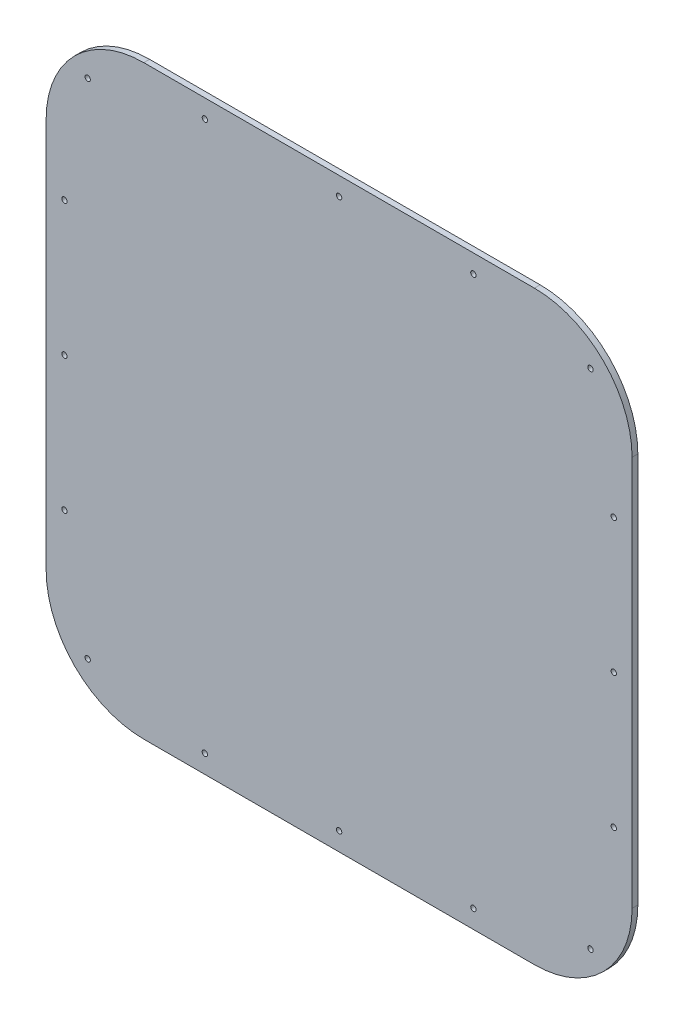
ISO-10303-21;
HEADER;
FILE_DESCRIPTION(('STEP AP214'),'2;1');
FILE_NAME('part.step','',(''),(''),'','','');
FILE_SCHEMA(('AUTOMOTIVE_DESIGN { 1 0 10303 214 1 1 1 1 }'));
ENDSEC;
DATA;
#1=APPLICATION_CONTEXT('core data for automotive mechanical design processes');
#2=APPLICATION_PROTOCOL_DEFINITION('international standard','automotive_design',2000,#1);
#3=PRODUCT_CONTEXT('',#1,'mechanical');
#4=PRODUCT('Part','Part','',(#3));
#5=PRODUCT_RELATED_PRODUCT_CATEGORY('part','',(#4));
#6=PRODUCT_DEFINITION_FORMATION('','',#4);
#7=PRODUCT_DEFINITION_CONTEXT('part definition',#1,'design');
#8=PRODUCT_DEFINITION('design','',#6,#7);
#9=PRODUCT_DEFINITION_SHAPE('','',#8);
#10=(LENGTH_UNIT() NAMED_UNIT(*) SI_UNIT(.MILLI.,.METRE.));
#11=(NAMED_UNIT(*) PLANE_ANGLE_UNIT() SI_UNIT($,.RADIAN.));
#12=(NAMED_UNIT(*) SI_UNIT($,.STERADIAN.) SOLID_ANGLE_UNIT());
#13=UNCERTAINTY_MEASURE_WITH_UNIT(LENGTH_MEASURE(1.E-05),#10,'distance_accuracy_value','');
#14=(GEOMETRIC_REPRESENTATION_CONTEXT(3) GLOBAL_UNCERTAINTY_ASSIGNED_CONTEXT((#13)) GLOBAL_UNIT_ASSIGNED_CONTEXT((#10,
#11,#12)) REPRESENTATION_CONTEXT('',''));
#15=CARTESIAN_POINT('',(0.,0.,0.));
#16=DIRECTION('',(0.,0.,1.));
#17=DIRECTION('',(1.,0.,0.));
#18=AXIS2_PLACEMENT_3D('',#15,#16,#17);
#19=CARTESIAN_POINT('',(203.200000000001,203.200000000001,6.00000000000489));
#20=DIRECTION('',(0.,0.,-1.));
#21=DIRECTION('',(-1.,0.,0.));
#22=AXIS2_PLACEMENT_3D('',#19,#20,#21);
#23=PLANE('',#22);
#24=CARTESIAN_POINT('',(203.200000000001,203.200000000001,6.00000000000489));
#25=DIRECTION('',(0.,0.,1.));
#26=DIRECTION('',(-1.,0.,0.));
#27=AXIS2_PLACEMENT_3D('',#24,#25,#26);
#28=CIRCLE('',#27,101.6);
#29=CARTESIAN_POINT('',(304.800000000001,203.200000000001,5.99999999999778));
#30=VERTEX_POINT('',#29);
#31=CARTESIAN_POINT('',(203.200000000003,304.800000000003,6.00000000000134));
#32=VERTEX_POINT('',#31);
#33=EDGE_CURVE('E155',#30,#32,#28,.T.);
#34=ORIENTED_EDGE('',*,*,#33,.T.);
#35=DIRECTION('',(-1.,0.,0.));
#36=VECTOR('',#35,1.);
#37=CARTESIAN_POINT('',(-203.2,304.8,6.00000000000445));
#38=LINE('',#37,#36);
#39=CARTESIAN_POINT('',(-203.2,304.8,6.00000000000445));
#40=VERTEX_POINT('',#39);
#41=EDGE_CURVE('E98',#32,#40,#38,.T.);
#42=ORIENTED_EDGE('',*,*,#41,.T.);
#43=CARTESIAN_POINT('',(-203.2,203.2,6.00000000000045));
#44=DIRECTION('',(0.,0.,1.));
#45=DIRECTION('',(1.,0.,0.));
#46=AXIS2_PLACEMENT_3D('',#43,#44,#45);
#47=CIRCLE('',#46,101.6);
#48=CARTESIAN_POINT('',(-304.8,203.200000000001,6.00000000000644));
#49=VERTEX_POINT('',#48);
#50=EDGE_CURVE('E171',#40,#49,#47,.T.);
#51=ORIENTED_EDGE('',*,*,#50,.T.);
#52=DIRECTION('',(0.,-1.,0.));
#53=VECTOR('',#52,1.);
#54=CARTESIAN_POINT('',(-304.8,203.200000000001,6.00000000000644));
#55=LINE('',#54,#53);
#56=CARTESIAN_POINT('',(-304.800000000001,-203.2,6.00000000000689));
#57=VERTEX_POINT('',#56);
#58=EDGE_CURVE('E185',#49,#57,#55,.T.);
#59=ORIENTED_EDGE('',*,*,#58,.T.);
#60=CARTESIAN_POINT('',(-203.200000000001,-203.199999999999,6.00000000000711));
#61=DIRECTION('',(0.,0.,1.));
#62=DIRECTION('',(1.,0.,0.));
#63=AXIS2_PLACEMENT_3D('',#60,#61,#62);
#64=CIRCLE('',#63,101.6);
#65=CARTESIAN_POINT('',(-203.200000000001,-304.799999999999,6.00000000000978));
#66=VERTEX_POINT('',#65);
#67=EDGE_CURVE('E118',#57,#66,#64,.T.);
#68=ORIENTED_EDGE('',*,*,#67,.T.);
#69=DIRECTION('',(1.00000000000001,0.,0.));
#70=VECTOR('',#69,1.);
#71=CARTESIAN_POINT('',(-203.200000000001,-304.799999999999,6.00000000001));
#72=LINE('',#71,#70);
#73=CARTESIAN_POINT('',(203.200000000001,-304.799999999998,6.00000000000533));
#74=VERTEX_POINT('',#73);
#75=EDGE_CURVE('E112',#66,#74,#72,.T.);
#76=ORIENTED_EDGE('',*,*,#75,.T.);
#77=CARTESIAN_POINT('',(203.2,-203.199999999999,6.00000000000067));
#78=DIRECTION('',(0.,0.,1.));
#79=DIRECTION('',(1.,0.,0.));
#80=AXIS2_PLACEMENT_3D('',#77,#78,#79);
#81=CIRCLE('',#80,101.6);
#82=CARTESIAN_POINT('',(304.800000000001,-203.199999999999,6.00000000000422));
#83=VERTEX_POINT('',#82);
#84=EDGE_CURVE('E116',#74,#83,#81,.T.);
#85=ORIENTED_EDGE('',*,*,#84,.T.);
#86=DIRECTION('',(0.,1.,0.));
#87=VECTOR('',#86,1.);
#88=CARTESIAN_POINT('',(304.800000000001,203.200000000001,5.99999999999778));
#89=LINE('',#88,#87);
#90=EDGE_CURVE('E54',#83,#30,#89,.T.);
#91=ORIENTED_EDGE('',*,*,#90,.T.);
#92=EDGE_LOOP('',(#34,#42,#51,#59,#68,#76,#85,#91));
#93=FACE_BOUND('',#92,.T.);
#94=CARTESIAN_POINT('',(1.77635683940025E-12,285.750000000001,6.00000000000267));
#95=DIRECTION('',(0.,0.,1.));
#96=DIRECTION('',(1.,0.,0.));
#97=AXIS2_PLACEMENT_3D('',#94,#95,#96);
#98=CIRCLE('',#97,2.778125);
#99=CARTESIAN_POINT('',(2.77812500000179,285.750000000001,6.00000000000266));
#100=VERTEX_POINT('',#99);
#101=EDGE_CURVE('E141',#100,#100,#98,.T.);
#102=ORIENTED_EDGE('',*,*,#101,.F.);
#103=EDGE_LOOP('',(#102));
#104=FACE_BOUND('',#103,.T.);
#105=CARTESIAN_POINT('',(-3.33066907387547E-13,-285.75,6.00000000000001));
#106=DIRECTION('',(0.,0.,1.));
#107=DIRECTION('',(1.,0.,0.));
#108=AXIS2_PLACEMENT_3D('',#105,#106,#107);
#109=CIRCLE('',#108,2.778125);
#110=CARTESIAN_POINT('',(2.77812499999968,-285.75,6.));
#111=VERTEX_POINT('',#110);
#112=EDGE_CURVE('E196',#111,#111,#109,.T.);
#113=ORIENTED_EDGE('',*,*,#112,.F.);
#114=EDGE_LOOP('',(#113));
#115=FACE_BOUND('',#114,.T.);
#116=CARTESIAN_POINT('',(-285.75,0.,6.00000000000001));
#117=DIRECTION('',(0.,0.,1.));
#118=DIRECTION('',(1.,0.,0.));
#119=AXIS2_PLACEMENT_3D('',#116,#117,#118);
#120=CIRCLE('',#119,2.77812500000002);
#121=CARTESIAN_POINT('',(-282.971875,0.,6.));
#122=VERTEX_POINT('',#121);
#123=EDGE_CURVE('E202',#122,#122,#120,.T.);
#124=ORIENTED_EDGE('',*,*,#123,.F.);
#125=EDGE_LOOP('',(#124));
#126=FACE_BOUND('',#125,.T.);
#127=CARTESIAN_POINT('',(285.750000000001,1.38777878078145E-12,6.00000000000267));
#128=DIRECTION('',(0.,0.,1.));
#129=DIRECTION('',(1.,0.,0.));
#130=AXIS2_PLACEMENT_3D('',#127,#128,#129);
#131=CIRCLE('',#130,2.77812500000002);
#132=CARTESIAN_POINT('',(288.528125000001,1.39640528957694E-12,6.00000000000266));
#133=VERTEX_POINT('',#132);
#134=EDGE_CURVE('E208',#133,#133,#131,.T.);
#135=ORIENTED_EDGE('',*,*,#134,.F.);
#136=EDGE_LOOP('',(#135));
#137=FACE_BOUND('',#136,.T.);
#138=CARTESIAN_POINT('',(-261.57166478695,261.571664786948,6.00000000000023));
#139=DIRECTION('',(0.,0.,1.));
#140=DIRECTION('',(1.,0.,0.));
#141=AXIS2_PLACEMENT_3D('',#138,#139,#140);
#142=CIRCLE('',#141,2.77812500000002);
#143=CARTESIAN_POINT('',(-258.79353978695,261.571664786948,6.00000000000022));
#144=VERTEX_POINT('',#143);
#145=EDGE_CURVE('E214',#144,#144,#142,.T.);
#146=ORIENTED_EDGE('',*,*,#145,.F.);
#147=EDGE_LOOP('',(#146));
#148=FACE_BOUND('',#147,.T.);
#149=CARTESIAN_POINT('',(261.57166478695,261.57166478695,5.99999999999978));
#150=DIRECTION('',(0.,0.,1.));
#151=DIRECTION('',(1.,0.,0.));
#152=AXIS2_PLACEMENT_3D('',#149,#150,#151);
#153=CIRCLE('',#152,2.77812500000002);
#154=CARTESIAN_POINT('',(264.34978978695,261.57166478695,5.99999999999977));
#155=VERTEX_POINT('',#154);
#156=EDGE_CURVE('E220',#155,#155,#153,.T.);
#157=ORIENTED_EDGE('',*,*,#156,.F.);
#158=EDGE_LOOP('',(#157));
#159=FACE_BOUND('',#158,.T.);
#160=CARTESIAN_POINT('',(261.571664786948,-261.571664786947,6.00000000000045));
#161=DIRECTION('',(0.,0.,1.));
#162=DIRECTION('',(1.,0.,0.));
#163=AXIS2_PLACEMENT_3D('',#160,#161,#162);
#164=CIRCLE('',#163,2.77812500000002);
#165=CARTESIAN_POINT('',(264.349789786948,-261.571664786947,6.00000000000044));
#166=VERTEX_POINT('',#165);
#167=EDGE_CURVE('E226',#166,#166,#164,.T.);
#168=ORIENTED_EDGE('',*,*,#167,.F.);
#169=EDGE_LOOP('',(#168));
#170=FACE_BOUND('',#169,.T.);
#171=CARTESIAN_POINT('',(-261.57166478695,-261.571664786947,6.00000000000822));
#172=DIRECTION('',(0.,0.,1.));
#173=DIRECTION('',(1.,0.,0.));
#174=AXIS2_PLACEMENT_3D('',#171,#172,#173);
#175=CIRCLE('',#174,2.77812500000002);
#176=CARTESIAN_POINT('',(-258.79353978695,-261.571664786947,6.00000000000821));
#177=VERTEX_POINT('',#176);
#178=EDGE_CURVE('E232',#177,#177,#175,.T.);
#179=ORIENTED_EDGE('',*,*,#178,.F.);
#180=EDGE_LOOP('',(#179));
#181=FACE_BOUND('',#180,.T.);
#182=CARTESIAN_POINT('',(-139.699999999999,285.750000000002,6.00000000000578));
#183=DIRECTION('',(0.,0.,1.));
#184=DIRECTION('',(1.,0.,0.));
#185=AXIS2_PLACEMENT_3D('',#182,#183,#184);
#186=CIRCLE('',#185,2.77812499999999);
#187=CARTESIAN_POINT('',(-136.921874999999,285.750000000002,6.00000000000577));
#188=VERTEX_POINT('',#187);
#189=EDGE_CURVE('E239',#188,#188,#186,.T.);
#190=ORIENTED_EDGE('',*,*,#189,.F.);
#191=EDGE_LOOP('',(#190));
#192=FACE_BOUND('',#191,.T.);
#193=CARTESIAN_POINT('',(139.700000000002,285.750000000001,6.000000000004));
#194=DIRECTION('',(0.,0.,1.));
#195=DIRECTION('',(1.,0.,0.));
#196=AXIS2_PLACEMENT_3D('',#193,#194,#195);
#197=CIRCLE('',#196,2.77812499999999);
#198=CARTESIAN_POINT('',(142.478125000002,285.750000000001,6.00000000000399));
#199=VERTEX_POINT('',#198);
#200=EDGE_CURVE('E247',#199,#199,#197,.T.);
#201=ORIENTED_EDGE('',*,*,#200,.F.);
#202=EDGE_LOOP('',(#201));
#203=FACE_BOUND('',#202,.T.);
#204=CARTESIAN_POINT('',(-139.7,-285.750000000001,6.00000000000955));
#205=DIRECTION('',(0.,0.,1.));
#206=DIRECTION('',(1.,0.,0.));
#207=AXIS2_PLACEMENT_3D('',#204,#205,#206);
#208=CIRCLE('',#207,2.77812499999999);
#209=CARTESIAN_POINT('',(-136.921875,-285.750000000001,6.00000000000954));
#210=VERTEX_POINT('',#209);
#211=EDGE_CURVE('E254',#210,#210,#208,.T.);
#212=ORIENTED_EDGE('',*,*,#211,.F.);
#213=EDGE_LOOP('',(#212));
#214=FACE_BOUND('',#213,.T.);
#215=CARTESIAN_POINT('',(139.699999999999,-285.749999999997,6.00000000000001));
#216=DIRECTION('',(0.,0.,1.));
#217=DIRECTION('',(1.,0.,0.));
#218=AXIS2_PLACEMENT_3D('',#215,#216,#217);
#219=CIRCLE('',#218,2.77812499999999);
#220=CARTESIAN_POINT('',(142.478124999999,-285.749999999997,6.));
#221=VERTEX_POINT('',#220);
#222=EDGE_CURVE('E260',#221,#221,#219,.T.);
#223=ORIENTED_EDGE('',*,*,#222,.F.);
#224=EDGE_LOOP('',(#223));
#225=FACE_BOUND('',#224,.T.);
#226=CARTESIAN_POINT('',(-285.750000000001,139.700000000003,6.00000000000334));
#227=DIRECTION('',(0.,0.,1.));
#228=DIRECTION('',(1.,0.,0.));
#229=AXIS2_PLACEMENT_3D('',#226,#227,#228);
#230=CIRCLE('',#229,2.77812500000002);
#231=CARTESIAN_POINT('',(-282.971875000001,139.700000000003,6.00000000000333));
#232=VERTEX_POINT('',#231);
#233=EDGE_CURVE('E267',#232,#232,#230,.T.);
#234=ORIENTED_EDGE('',*,*,#233,.F.);
#235=EDGE_LOOP('',(#234));
#236=FACE_BOUND('',#235,.T.);
#237=CARTESIAN_POINT('',(-285.749999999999,-139.7,6.00000000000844));
#238=DIRECTION('',(0.,0.,1.));
#239=DIRECTION('',(1.,0.,0.));
#240=AXIS2_PLACEMENT_3D('',#237,#238,#239);
#241=CIRCLE('',#240,2.77812500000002);
#242=CARTESIAN_POINT('',(-282.971874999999,-139.7,6.00000000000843));
#243=VERTEX_POINT('',#242);
#244=EDGE_CURVE('E273',#243,#243,#241,.T.);
#245=ORIENTED_EDGE('',*,*,#244,.F.);
#246=EDGE_LOOP('',(#245));
#247=FACE_BOUND('',#246,.T.);
#248=CARTESIAN_POINT('',(285.750000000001,-139.699999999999,6.00000000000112));
#249=DIRECTION('',(0.,0.,1.));
#250=DIRECTION('',(1.,0.,0.));
#251=AXIS2_PLACEMENT_3D('',#248,#249,#250);
#252=CIRCLE('',#251,2.77812500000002);
#253=CARTESIAN_POINT('',(288.528125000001,-139.699999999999,6.00000000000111));
#254=VERTEX_POINT('',#253);
#255=EDGE_CURVE('E279',#254,#254,#252,.T.);
#256=ORIENTED_EDGE('',*,*,#255,.F.);
#257=EDGE_LOOP('',(#256));
#258=FACE_BOUND('',#257,.T.);
#259=CARTESIAN_POINT('',(285.75,139.7,6.00000000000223));
#260=DIRECTION('',(0.,0.,1.));
#261=DIRECTION('',(1.,0.,0.));
#262=AXIS2_PLACEMENT_3D('',#259,#260,#261);
#263=CIRCLE('',#262,2.77812500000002);
#264=CARTESIAN_POINT('',(288.528125,139.7,6.00000000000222));
#265=VERTEX_POINT('',#264);
#266=EDGE_CURVE('E285',#265,#265,#263,.T.);
#267=ORIENTED_EDGE('',*,*,#266,.F.);
#268=EDGE_LOOP('',(#267));
#269=FACE_BOUND('',#268,.T.);
#270=ADVANCED_FACE('F37',(#93,#104,#115,#126,#137,#148,#159,#170,#181,#192,#203,#214,#225,#236,
#247,#258,#269),#23,.F.);
#271=CARTESIAN_POINT('',(203.200000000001,203.200000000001,1.55431223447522E-12));
#272=DIRECTION('',(0.,0.,-1.));
#273=DIRECTION('',(-1.,0.,0.));
#274=AXIS2_PLACEMENT_3D('',#271,#272,#273);
#275=PLANE('',#274);
#276=CARTESIAN_POINT('',(285.75,-139.7,2.22044604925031E-13));
#277=DIRECTION('',(0.,0.,1.));
#278=DIRECTION('',(1.,0.,0.));
#279=AXIS2_PLACEMENT_3D('',#276,#277,#278);
#280=CIRCLE('',#279,2.77812500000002);
#281=CARTESIAN_POINT('',(288.528125,-139.7,2.13716891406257E-13));
#282=VERTEX_POINT('',#281);
#283=EDGE_CURVE('E282',#282,#282,#280,.T.);
#284=ORIENTED_EDGE('',*,*,#283,.T.);
#285=EDGE_LOOP('',(#284));
#286=FACE_BOUND('',#285,.T.);
#287=CARTESIAN_POINT('',(-285.75,139.700000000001,7.32747196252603E-12));
#288=DIRECTION('',(0.,0.,1.));
#289=DIRECTION('',(1.,0.,0.));
#290=AXIS2_PLACEMENT_3D('',#287,#288,#289);
#291=CIRCLE('',#290,2.77812500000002);
#292=CARTESIAN_POINT('',(-282.971875,139.700000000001,7.31914424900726E-12));
#293=VERTEX_POINT('',#292);
#294=EDGE_CURVE('E270',#293,#293,#291,.T.);
#295=ORIENTED_EDGE('',*,*,#294,.T.);
#296=EDGE_LOOP('',(#295));
#297=FACE_BOUND('',#296,.T.);
#298=CARTESIAN_POINT('',(-139.7,-285.750000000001,4.66293670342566E-12));
#299=DIRECTION('',(0.,0.,1.));
#300=DIRECTION('',(1.,0.,0.));
#301=AXIS2_PLACEMENT_3D('',#298,#299,#300);
#302=CIRCLE('',#301,2.77812499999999);
#303=CARTESIAN_POINT('',(-136.921875,-285.750000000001,4.65460898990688E-12));
#304=VERTEX_POINT('',#303);
#305=EDGE_CURVE('E257',#304,#304,#302,.T.);
#306=ORIENTED_EDGE('',*,*,#305,.T.);
#307=EDGE_LOOP('',(#306));
#308=FACE_BOUND('',#307,.T.);
#309=CARTESIAN_POINT('',(-139.699999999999,285.750000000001,2.22044604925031E-13));
#310=DIRECTION('',(0.,0.,1.));
#311=DIRECTION('',(1.,0.,0.));
#312=AXIS2_PLACEMENT_3D('',#309,#310,#311);
#313=CIRCLE('',#312,2.77812499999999);
#314=CARTESIAN_POINT('',(-136.921874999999,285.750000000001,2.13716891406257E-13));
#315=VERTEX_POINT('',#314);
#316=EDGE_CURVE('E243',#315,#315,#313,.T.);
#317=ORIENTED_EDGE('',*,*,#316,.T.);
#318=EDGE_LOOP('',(#317));
#319=FACE_BOUND('',#318,.T.);
#320=CARTESIAN_POINT('',(261.57166478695,-261.571664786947,3.77475828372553E-12));
#321=DIRECTION('',(0.,0.,1.));
#322=DIRECTION('',(1.,0.,0.));
#323=AXIS2_PLACEMENT_3D('',#320,#321,#322);
#324=CIRCLE('',#323,2.77812500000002);
#325=CARTESIAN_POINT('',(264.34978978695,-261.571664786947,3.76643057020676E-12));
#326=VERTEX_POINT('',#325);
#327=EDGE_CURVE('E229',#326,#326,#324,.T.);
#328=ORIENTED_EDGE('',*,*,#327,.T.);
#329=EDGE_LOOP('',(#328));
#330=FACE_BOUND('',#329,.T.);
#331=CARTESIAN_POINT('',(-261.571664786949,261.571664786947,7.7715611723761E-12));
#332=DIRECTION('',(0.,0.,1.));
#333=DIRECTION('',(1.,0.,0.));
#334=AXIS2_PLACEMENT_3D('',#331,#332,#333);
#335=CIRCLE('',#334,2.77812500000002);
#336=CARTESIAN_POINT('',(-258.793539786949,261.571664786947,7.76323345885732E-12));
#337=VERTEX_POINT('',#336);
#338=EDGE_CURVE('E217',#337,#337,#335,.T.);
#339=ORIENTED_EDGE('',*,*,#338,.T.);
#340=EDGE_LOOP('',(#339));
#341=FACE_BOUND('',#340,.T.);
#342=CARTESIAN_POINT('',(-285.750000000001,-2.77555756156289E-13,5.55111512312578E-12));
#343=DIRECTION('',(0.,0.,1.));
#344=DIRECTION('',(1.,0.,0.));
#345=AXIS2_PLACEMENT_3D('',#342,#343,#344);
#346=CIRCLE('',#345,2.77812500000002);
#347=CARTESIAN_POINT('',(-282.971875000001,-2.689292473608E-13,5.54278740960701E-12));
#348=VERTEX_POINT('',#347);
#349=EDGE_CURVE('E205',#348,#348,#346,.T.);
#350=ORIENTED_EDGE('',*,*,#349,.T.);
#351=EDGE_LOOP('',(#350));
#352=FACE_BOUND('',#351,.T.);
#353=CARTESIAN_POINT('',(2.77555756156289E-13,285.750000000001,2.22044604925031E-13));
#354=DIRECTION('',(0.,0.,1.));
#355=DIRECTION('',(1.,0.,0.));
#356=AXIS2_PLACEMENT_3D('',#353,#354,#355);
#357=CIRCLE('',#356,2.778125);
#358=CARTESIAN_POINT('',(2.77812500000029,285.750000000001,2.13716891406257E-13));
#359=VERTEX_POINT('',#358);
#360=EDGE_CURVE('E193',#359,#359,#357,.T.);
#361=ORIENTED_EDGE('',*,*,#360,.T.);
#362=EDGE_LOOP('',(#361));
#363=FACE_BOUND('',#362,.T.);
#364=CARTESIAN_POINT('',(203.200000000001,203.200000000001,1.55431223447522E-12));
#365=DIRECTION('',(0.,0.,1.));
#366=DIRECTION('',(-1.,0.,0.));
#367=AXIS2_PLACEMENT_3D('',#364,#365,#366);
#368=CIRCLE('',#367,101.6);
#369=CARTESIAN_POINT('',(304.8,203.2,0.));
#370=VERTEX_POINT('',#369);
#371=CARTESIAN_POINT('',(203.200000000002,304.800000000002,4.21884749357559E-12));
#372=VERTEX_POINT('',#371);
#373=EDGE_CURVE('E137',#370,#372,#368,.T.);
#374=ORIENTED_EDGE('',*,*,#373,.F.);
#375=DIRECTION('',(0.,1.,0.));
#376=VECTOR('',#375,1.);
#377=CARTESIAN_POINT('',(304.8,203.2,0.));
#378=LINE('',#377,#376);
#379=CARTESIAN_POINT('',(304.800000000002,-203.199999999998,1.33226762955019E-12));
#380=VERTEX_POINT('',#379);
#381=EDGE_CURVE('E90',#380,#370,#378,.T.);
#382=ORIENTED_EDGE('',*,*,#381,.F.);
#383=CARTESIAN_POINT('',(203.2,-203.2,-1.11022302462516E-12));
#384=DIRECTION('',(0.,0.,1.));
#385=DIRECTION('',(1.,0.,0.));
#386=AXIS2_PLACEMENT_3D('',#383,#384,#385);
#387=CIRCLE('',#386,101.6);
#388=CARTESIAN_POINT('',(203.2,-304.799999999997,4.44089209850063E-12));
#389=VERTEX_POINT('',#388);
#390=EDGE_CURVE('E84',#389,#380,#387,.T.);
#391=ORIENTED_EDGE('',*,*,#390,.F.);
#392=DIRECTION('',(1.00000000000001,0.,0.));
#393=VECTOR('',#392,1.);
#394=CARTESIAN_POINT('',(-203.2,-304.799999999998,4.44089209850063E-13));
#395=LINE('',#394,#393);
#396=CARTESIAN_POINT('',(-203.200000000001,-304.799999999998,5.99520433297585E-12));
#397=VERTEX_POINT('',#396);
#398=EDGE_CURVE('E127',#397,#389,#395,.T.);
#399=ORIENTED_EDGE('',*,*,#398,.F.);
#400=CARTESIAN_POINT('',(-203.2,-203.2,3.77475828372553E-12));
#401=DIRECTION('',(0.,0.,1.));
#402=DIRECTION('',(1.,0.,0.));
#403=AXIS2_PLACEMENT_3D('',#400,#401,#402);
#404=CIRCLE('',#403,101.6);
#405=CARTESIAN_POINT('',(-304.800000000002,-203.2,5.55111512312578E-12));
#406=VERTEX_POINT('',#405);
#407=EDGE_CURVE('E148',#406,#397,#404,.T.);
#408=ORIENTED_EDGE('',*,*,#407,.F.);
#409=DIRECTION('',(0.,-1.,0.));
#410=VECTOR('',#409,1.);
#411=CARTESIAN_POINT('',(-304.8,203.200000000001,4.44089209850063E-12));
#412=LINE('',#411,#410);
#413=CARTESIAN_POINT('',(-304.8,203.200000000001,4.44089209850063E-12));
#414=VERTEX_POINT('',#413);
#415=EDGE_CURVE('E146',#414,#406,#412,.T.);
#416=ORIENTED_EDGE('',*,*,#415,.F.);
#417=CARTESIAN_POINT('',(-203.2,203.199999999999,7.7715611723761E-12));
#418=DIRECTION('',(0.,0.,1.));
#419=DIRECTION('',(1.,0.,0.));
#420=AXIS2_PLACEMENT_3D('',#417,#418,#419);
#421=CIRCLE('',#420,101.6);
#422=CARTESIAN_POINT('',(-203.199999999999,304.800000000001,1.11022302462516E-12));
#423=VERTEX_POINT('',#422);
#424=EDGE_CURVE('E143',#423,#414,#421,.T.);
#425=ORIENTED_EDGE('',*,*,#424,.F.);
#426=DIRECTION('',(-1.,0.,0.));
#427=VECTOR('',#426,1.);
#428=CARTESIAN_POINT('',(-203.199999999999,304.800000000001,1.11022302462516E-12));
#429=LINE('',#428,#427);
#430=EDGE_CURVE('E140',#372,#423,#429,.T.);
#431=ORIENTED_EDGE('',*,*,#430,.F.);
#432=EDGE_LOOP('',(#374,#382,#391,#399,#408,#416,#425,#431));
#433=FACE_BOUND('',#432,.T.);
#434=CARTESIAN_POINT('',(0.,-285.75,0.));
#435=DIRECTION('',(0.,0.,1.));
#436=DIRECTION('',(1.,0.,0.));
#437=AXIS2_PLACEMENT_3D('',#434,#435,#436);
#438=CIRCLE('',#437,2.778125);
#439=CARTESIAN_POINT('',(2.77812499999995,-285.75,0.));
#440=VERTEX_POINT('',#439);
#441=EDGE_CURVE('E199',#440,#440,#438,.T.);
#442=ORIENTED_EDGE('',*,*,#441,.T.);
#443=EDGE_LOOP('',(#442));
#444=FACE_BOUND('',#443,.T.);
#445=CARTESIAN_POINT('',(285.750000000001,1.33226762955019E-12,-8.88178419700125E-13));
#446=DIRECTION('',(0.,0.,1.));
#447=DIRECTION('',(1.,0.,0.));
#448=AXIS2_PLACEMENT_3D('',#445,#446,#447);
#449=CIRCLE('',#448,2.77812500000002);
#450=CARTESIAN_POINT('',(288.528125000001,1.34089413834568E-12,-8.965061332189E-13));
#451=VERTEX_POINT('',#450);
#452=EDGE_CURVE('E211',#451,#451,#449,.T.);
#453=ORIENTED_EDGE('',*,*,#452,.T.);
#454=EDGE_LOOP('',(#453));
#455=FACE_BOUND('',#454,.T.);
#456=CARTESIAN_POINT('',(261.57166478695,261.57166478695,0.));
#457=DIRECTION('',(0.,0.,1.));
#458=DIRECTION('',(1.,0.,0.));
#459=AXIS2_PLACEMENT_3D('',#456,#457,#458);
#460=CIRCLE('',#459,2.77812500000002);
#461=CARTESIAN_POINT('',(264.34978978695,261.57166478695,0.));
#462=VERTEX_POINT('',#461);
#463=EDGE_CURVE('E223',#462,#462,#460,.T.);
#464=ORIENTED_EDGE('',*,*,#463,.T.);
#465=EDGE_LOOP('',(#464));
#466=FACE_BOUND('',#465,.T.);
#467=CARTESIAN_POINT('',(-261.57166478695,-261.571664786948,5.10702591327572E-12));
#468=DIRECTION('',(0.,0.,1.));
#469=DIRECTION('',(1.,0.,0.));
#470=AXIS2_PLACEMENT_3D('',#467,#468,#469);
#471=CIRCLE('',#470,2.77812500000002);
#472=CARTESIAN_POINT('',(-258.79353978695,-261.571664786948,5.09869819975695E-12));
#473=VERTEX_POINT('',#472);
#474=EDGE_CURVE('E235',#473,#473,#471,.T.);
#475=ORIENTED_EDGE('',*,*,#474,.T.);
#476=EDGE_LOOP('',(#475));
#477=FACE_BOUND('',#476,.T.);
#478=CARTESIAN_POINT('',(139.7,285.750000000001,2.22044604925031E-13));
#479=DIRECTION('',(0.,0.,1.));
#480=DIRECTION('',(1.,0.,0.));
#481=AXIS2_PLACEMENT_3D('',#478,#479,#480);
#482=CIRCLE('',#481,2.77812499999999);
#483=CARTESIAN_POINT('',(142.478125,285.750000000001,2.13716891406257E-13));
#484=VERTEX_POINT('',#483);
#485=EDGE_CURVE('E251',#484,#484,#482,.T.);
#486=ORIENTED_EDGE('',*,*,#485,.T.);
#487=EDGE_LOOP('',(#486));
#488=FACE_BOUND('',#487,.T.);
#489=CARTESIAN_POINT('',(139.699999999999,-285.749999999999,7.32747196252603E-12));
#490=DIRECTION('',(0.,0.,1.));
#491=DIRECTION('',(1.,0.,0.));
#492=AXIS2_PLACEMENT_3D('',#489,#490,#491);
#493=CIRCLE('',#492,2.77812499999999);
#494=CARTESIAN_POINT('',(142.478124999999,-285.749999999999,7.31914424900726E-12));
#495=VERTEX_POINT('',#494);
#496=EDGE_CURVE('E264',#495,#495,#493,.T.);
#497=ORIENTED_EDGE('',*,*,#496,.T.);
#498=EDGE_LOOP('',(#497));
#499=FACE_BOUND('',#498,.T.);
#500=CARTESIAN_POINT('',(-285.749999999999,-139.7,5.10702591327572E-12));
#501=DIRECTION('',(0.,0.,1.));
#502=DIRECTION('',(1.,0.,0.));
#503=AXIS2_PLACEMENT_3D('',#500,#501,#502);
#504=CIRCLE('',#503,2.77812500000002);
#505=CARTESIAN_POINT('',(-282.971874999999,-139.7,5.09869819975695E-12));
#506=VERTEX_POINT('',#505);
#507=EDGE_CURVE('E276',#506,#506,#504,.T.);
#508=ORIENTED_EDGE('',*,*,#507,.T.);
#509=EDGE_LOOP('',(#508));
#510=FACE_BOUND('',#509,.T.);
#511=CARTESIAN_POINT('',(285.75,139.7,0.));
#512=DIRECTION('',(0.,0.,1.));
#513=DIRECTION('',(1.,0.,0.));
#514=AXIS2_PLACEMENT_3D('',#511,#512,#513);
#515=CIRCLE('',#514,2.77812500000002);
#516=CARTESIAN_POINT('',(288.528125,139.7,0.));
#517=VERTEX_POINT('',#516);
#518=EDGE_CURVE('E288',#517,#517,#515,.T.);
#519=ORIENTED_EDGE('',*,*,#518,.T.);
#520=EDGE_LOOP('',(#519));
#521=FACE_BOUND('',#520,.T.);
#522=ADVANCED_FACE('F175',(#286,#297,#308,#319,#330,#341,#352,#363,#433,#444,#455,#466,#477,
#488,#499,#510,#521),#275,.T.);
#523=CARTESIAN_POINT('',(203.200000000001,203.200000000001,6.00000000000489));
#524=DIRECTION('',(0.,0.,-1.));
#525=DIRECTION('',(-1.,0.,0.));
#526=AXIS2_PLACEMENT_3D('',#523,#524,#525);
#527=CYLINDRICAL_SURFACE('',#526,101.6);
#528=ORIENTED_EDGE('',*,*,#373,.T.);
#529=DIRECTION('',(0.,0.,-1.));
#530=VECTOR('',#529,1.);
#531=CARTESIAN_POINT('',(203.200000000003,304.800000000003,6.00000000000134));
#532=LINE('',#531,#530);
#533=EDGE_CURVE('E11',#32,#372,#532,.T.);
#534=ORIENTED_EDGE('',*,*,#533,.F.);
#535=ORIENTED_EDGE('',*,*,#33,.F.);
#536=DIRECTION('',(0.,0.,-1.));
#537=VECTOR('',#536,1.);
#538=CARTESIAN_POINT('',(304.800000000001,203.200000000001,5.99999999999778));
#539=LINE('',#538,#537);
#540=EDGE_CURVE('E133',#30,#370,#539,.T.);
#541=ORIENTED_EDGE('',*,*,#540,.T.);
#542=EDGE_LOOP('',(#528,#534,#535,#541));
#543=FACE_BOUND('',#542,.T.);
#544=ADVANCED_FACE('F39',(#543),#527,.T.);
#545=CARTESIAN_POINT('',(-203.2,304.8,6.00000000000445));
#546=DIRECTION('',(0.,-1.,0.));
#547=DIRECTION('',(1.,0.,0.));
#548=AXIS2_PLACEMENT_3D('',#545,#546,#547);
#549=PLANE('',#548);
#550=ORIENTED_EDGE('',*,*,#430,.T.);
#551=DIRECTION('',(0.,0.,-1.));
#552=VECTOR('',#551,1.);
#553=CARTESIAN_POINT('',(-203.2,304.8,6.00000000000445));
#554=LINE('',#553,#552);
#555=EDGE_CURVE('E46',#40,#423,#554,.T.);
#556=ORIENTED_EDGE('',*,*,#555,.F.);
#557=ORIENTED_EDGE('',*,*,#41,.F.);
#558=ORIENTED_EDGE('',*,*,#533,.T.);
#559=EDGE_LOOP('',(#550,#556,#557,#558));
#560=FACE_BOUND('',#559,.T.);
#561=ADVANCED_FACE('F320',(#560),#549,.F.);
#562=CARTESIAN_POINT('',(-203.2,203.2,6.00000000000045));
#563=DIRECTION('',(0.,0.,-1.));
#564=DIRECTION('',(-1.,0.,0.));
#565=AXIS2_PLACEMENT_3D('',#562,#563,#564);
#566=CYLINDRICAL_SURFACE('',#565,101.6);
#567=ORIENTED_EDGE('',*,*,#424,.T.);
#568=DIRECTION('',(0.,0.,-1.));
#569=VECTOR('',#568,1.);
#570=CARTESIAN_POINT('',(-304.8,203.200000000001,6.00000000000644));
#571=LINE('',#570,#569);
#572=EDGE_CURVE('E163',#49,#414,#571,.T.);
#573=ORIENTED_EDGE('',*,*,#572,.F.);
#574=ORIENTED_EDGE('',*,*,#50,.F.);
#575=ORIENTED_EDGE('',*,*,#555,.T.);
#576=EDGE_LOOP('',(#567,#573,#574,#575));
#577=FACE_BOUND('',#576,.T.);
#578=ADVANCED_FACE('F169',(#577),#566,.T.);
#579=CARTESIAN_POINT('',(-304.8,203.200000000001,6.00000000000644));
#580=DIRECTION('',(1.,0.,0.));
#581=DIRECTION('',(0.,0.,-1.));
#582=AXIS2_PLACEMENT_3D('',#579,#580,#581);
#583=PLANE('',#582);
#584=ORIENTED_EDGE('',*,*,#415,.T.);
#585=DIRECTION('',(0.,0.,-1.));
#586=VECTOR('',#585,1.);
#587=CARTESIAN_POINT('',(-304.800000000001,-203.2,6.00000000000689));
#588=LINE('',#587,#586);
#589=EDGE_CURVE('E160',#57,#406,#588,.T.);
#590=ORIENTED_EDGE('',*,*,#589,.F.);
#591=ORIENTED_EDGE('',*,*,#58,.F.);
#592=ORIENTED_EDGE('',*,*,#572,.T.);
#593=EDGE_LOOP('',(#584,#590,#591,#592));
#594=FACE_BOUND('',#593,.T.);
#595=ADVANCED_FACE('F180',(#594),#583,.F.);
#596=CARTESIAN_POINT('',(-203.200000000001,-203.199999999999,6.00000000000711));
#597=DIRECTION('',(0.,0.,-1.));
#598=DIRECTION('',(-1.,0.,0.));
#599=AXIS2_PLACEMENT_3D('',#596,#597,#598);
#600=CYLINDRICAL_SURFACE('',#599,101.6);
#601=ORIENTED_EDGE('',*,*,#407,.T.);
#602=DIRECTION('',(0.,0.,-1.));
#603=VECTOR('',#602,1.);
#604=CARTESIAN_POINT('',(-203.200000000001,-304.799999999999,6.00000000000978));
#605=LINE('',#604,#603);
#606=EDGE_CURVE('E128',#66,#397,#605,.T.);
#607=ORIENTED_EDGE('',*,*,#606,.F.);
#608=ORIENTED_EDGE('',*,*,#67,.F.);
#609=ORIENTED_EDGE('',*,*,#589,.T.);
#610=EDGE_LOOP('',(#601,#607,#608,#609));
#611=FACE_BOUND('',#610,.T.);
#612=ADVANCED_FACE('F183',(#611),#600,.T.);
#613=CARTESIAN_POINT('',(-203.200000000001,-304.799999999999,6.00000000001));
#614=DIRECTION('',(0.,1.,0.));
#615=DIRECTION('',(-1.00000000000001,0.,0.));
#616=AXIS2_PLACEMENT_3D('',#613,#614,#615);
#617=PLANE('',#616);
#618=ORIENTED_EDGE('',*,*,#398,.T.);
#619=DIRECTION('',(0.,0.,-1.));
#620=VECTOR('',#619,1.);
#621=CARTESIAN_POINT('',(203.200000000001,-304.799999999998,6.00000000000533));
#622=LINE('',#621,#620);
#623=EDGE_CURVE('E124',#74,#389,#622,.T.);
#624=ORIENTED_EDGE('',*,*,#623,.F.);
#625=ORIENTED_EDGE('',*,*,#75,.F.);
#626=ORIENTED_EDGE('',*,*,#606,.T.);
#627=EDGE_LOOP('',(#618,#624,#625,#626));
#628=FACE_BOUND('',#627,.T.);
#629=ADVANCED_FACE('F125',(#628),#617,.F.);
#630=CARTESIAN_POINT('',(203.2,-203.199999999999,6.00000000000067));
#631=DIRECTION('',(0.,0.,-1.));
#632=DIRECTION('',(-1.,0.,0.));
#633=AXIS2_PLACEMENT_3D('',#630,#631,#632);
#634=CYLINDRICAL_SURFACE('',#633,101.6);
#635=ORIENTED_EDGE('',*,*,#390,.T.);
#636=DIRECTION('',(0.,0.,-1.));
#637=VECTOR('',#636,1.);
#638=CARTESIAN_POINT('',(304.800000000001,-203.199999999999,6.00000000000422));
#639=LINE('',#638,#637);
#640=EDGE_CURVE('E129',#83,#380,#639,.T.);
#641=ORIENTED_EDGE('',*,*,#640,.F.);
#642=ORIENTED_EDGE('',*,*,#84,.F.);
#643=ORIENTED_EDGE('',*,*,#623,.T.);
#644=EDGE_LOOP('',(#635,#641,#642,#643));
#645=FACE_BOUND('',#644,.T.);
#646=ADVANCED_FACE('F131',(#645),#634,.T.);
#647=CARTESIAN_POINT('',(304.800000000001,203.200000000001,5.99999999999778));
#648=DIRECTION('',(-1.00000000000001,0.,0.));
#649=DIRECTION('',(0.,-1.,0.));
#650=AXIS2_PLACEMENT_3D('',#647,#648,#649);
#651=PLANE('',#650);
#652=ORIENTED_EDGE('',*,*,#381,.T.);
#653=ORIENTED_EDGE('',*,*,#540,.F.);
#654=ORIENTED_EDGE('',*,*,#90,.F.);
#655=ORIENTED_EDGE('',*,*,#640,.T.);
#656=EDGE_LOOP('',(#652,#653,#654,#655));
#657=FACE_BOUND('',#656,.T.);
#658=ADVANCED_FACE('F308',(#657),#651,.F.);
#659=CARTESIAN_POINT('',(1.77635683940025E-12,285.750000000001,6.00000000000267));
#660=DIRECTION('',(0.,0.,-1.));
#661=DIRECTION('',(-1.,0.,0.));
#662=AXIS2_PLACEMENT_3D('',#659,#660,#661);
#663=CYLINDRICAL_SURFACE('',#662,2.778125);
#664=ORIENTED_EDGE('',*,*,#101,.T.);
#665=EDGE_LOOP('',(#664));
#666=FACE_BOUND('',#665,.T.);
#667=ORIENTED_EDGE('',*,*,#360,.F.);
#668=EDGE_LOOP('',(#667));
#669=FACE_BOUND('',#668,.T.);
#670=ADVANCED_FACE('F305',(#666,#669),#663,.F.);
#671=CARTESIAN_POINT('',(-3.33066907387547E-13,-285.75,6.00000000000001));
#672=DIRECTION('',(0.,0.,-1.));
#673=DIRECTION('',(-1.,0.,0.));
#674=AXIS2_PLACEMENT_3D('',#671,#672,#673);
#675=CYLINDRICAL_SURFACE('',#674,2.778125);
#676=ORIENTED_EDGE('',*,*,#112,.T.);
#677=EDGE_LOOP('',(#676));
#678=FACE_BOUND('',#677,.T.);
#679=ORIENTED_EDGE('',*,*,#441,.F.);
#680=EDGE_LOOP('',(#679));
#681=FACE_BOUND('',#680,.T.);
#682=ADVANCED_FACE('F371',(#678,#681),#675,.F.);
#683=CARTESIAN_POINT('',(-285.75,0.,6.00000000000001));
#684=DIRECTION('',(0.,0.,-1.));
#685=DIRECTION('',(-1.,0.,0.));
#686=AXIS2_PLACEMENT_3D('',#683,#684,#685);
#687=CYLINDRICAL_SURFACE('',#686,2.77812500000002);
#688=ORIENTED_EDGE('',*,*,#123,.T.);
#689=EDGE_LOOP('',(#688));
#690=FACE_BOUND('',#689,.T.);
#691=ORIENTED_EDGE('',*,*,#349,.F.);
#692=EDGE_LOOP('',(#691));
#693=FACE_BOUND('',#692,.T.);
#694=ADVANCED_FACE('F378',(#690,#693),#687,.F.);
#695=CARTESIAN_POINT('',(285.750000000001,1.38777878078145E-12,6.00000000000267));
#696=DIRECTION('',(0.,0.,-1.));
#697=DIRECTION('',(-1.,0.,0.));
#698=AXIS2_PLACEMENT_3D('',#695,#696,#697);
#699=CYLINDRICAL_SURFACE('',#698,2.77812500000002);
#700=ORIENTED_EDGE('',*,*,#134,.T.);
#701=EDGE_LOOP('',(#700));
#702=FACE_BOUND('',#701,.T.);
#703=ORIENTED_EDGE('',*,*,#452,.F.);
#704=EDGE_LOOP('',(#703));
#705=FACE_BOUND('',#704,.T.);
#706=ADVANCED_FACE('F385',(#702,#705),#699,.F.);
#707=CARTESIAN_POINT('',(-261.57166478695,261.571664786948,6.00000000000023));
#708=DIRECTION('',(0.,0.,-1.));
#709=DIRECTION('',(-1.,0.,0.));
#710=AXIS2_PLACEMENT_3D('',#707,#708,#709);
#711=CYLINDRICAL_SURFACE('',#710,2.77812500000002);
#712=ORIENTED_EDGE('',*,*,#145,.T.);
#713=EDGE_LOOP('',(#712));
#714=FACE_BOUND('',#713,.T.);
#715=ORIENTED_EDGE('',*,*,#338,.F.);
#716=EDGE_LOOP('',(#715));
#717=FACE_BOUND('',#716,.T.);
#718=ADVANCED_FACE('F393',(#714,#717),#711,.F.);
#719=CARTESIAN_POINT('',(261.57166478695,261.57166478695,5.99999999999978));
#720=DIRECTION('',(0.,0.,-1.));
#721=DIRECTION('',(-1.,0.,0.));
#722=AXIS2_PLACEMENT_3D('',#719,#720,#721);
#723=CYLINDRICAL_SURFACE('',#722,2.77812500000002);
#724=ORIENTED_EDGE('',*,*,#156,.T.);
#725=EDGE_LOOP('',(#724));
#726=FACE_BOUND('',#725,.T.);
#727=ORIENTED_EDGE('',*,*,#463,.F.);
#728=EDGE_LOOP('',(#727));
#729=FACE_BOUND('',#728,.T.);
#730=ADVANCED_FACE('F401',(#726,#729),#723,.F.);
#731=CARTESIAN_POINT('',(261.571664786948,-261.571664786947,6.00000000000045));
#732=DIRECTION('',(0.,0.,-1.));
#733=DIRECTION('',(-1.,0.,0.));
#734=AXIS2_PLACEMENT_3D('',#731,#732,#733);
#735=CYLINDRICAL_SURFACE('',#734,2.77812500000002);
#736=ORIENTED_EDGE('',*,*,#167,.T.);
#737=EDGE_LOOP('',(#736));
#738=FACE_BOUND('',#737,.T.);
#739=ORIENTED_EDGE('',*,*,#327,.F.);
#740=EDGE_LOOP('',(#739));
#741=FACE_BOUND('',#740,.T.);
#742=ADVANCED_FACE('F409',(#738,#741),#735,.F.);
#743=CARTESIAN_POINT('',(-261.57166478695,-261.571664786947,6.00000000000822));
#744=DIRECTION('',(0.,0.,-1.));
#745=DIRECTION('',(-1.,0.,0.));
#746=AXIS2_PLACEMENT_3D('',#743,#744,#745);
#747=CYLINDRICAL_SURFACE('',#746,2.77812500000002);
#748=ORIENTED_EDGE('',*,*,#178,.T.);
#749=EDGE_LOOP('',(#748));
#750=FACE_BOUND('',#749,.T.);
#751=ORIENTED_EDGE('',*,*,#474,.F.);
#752=EDGE_LOOP('',(#751));
#753=FACE_BOUND('',#752,.T.);
#754=ADVANCED_FACE('F417',(#750,#753),#747,.F.);
#755=CARTESIAN_POINT('',(-139.699999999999,285.750000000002,6.00000000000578));
#756=DIRECTION('',(0.,0.,-1.));
#757=DIRECTION('',(-1.,0.,0.));
#758=AXIS2_PLACEMENT_3D('',#755,#756,#757);
#759=CYLINDRICAL_SURFACE('',#758,2.77812499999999);
#760=ORIENTED_EDGE('',*,*,#189,.T.);
#761=EDGE_LOOP('',(#760));
#762=FACE_BOUND('',#761,.T.);
#763=ORIENTED_EDGE('',*,*,#316,.F.);
#764=EDGE_LOOP('',(#763));
#765=FACE_BOUND('',#764,.T.);
#766=ADVANCED_FACE('F425',(#762,#765),#759,.F.);
#767=CARTESIAN_POINT('',(139.700000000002,285.750000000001,6.000000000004));
#768=DIRECTION('',(0.,0.,-1.));
#769=DIRECTION('',(-1.,0.,0.));
#770=AXIS2_PLACEMENT_3D('',#767,#768,#769);
#771=CYLINDRICAL_SURFACE('',#770,2.77812499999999);
#772=ORIENTED_EDGE('',*,*,#200,.T.);
#773=EDGE_LOOP('',(#772));
#774=FACE_BOUND('',#773,.T.);
#775=ORIENTED_EDGE('',*,*,#485,.F.);
#776=EDGE_LOOP('',(#775));
#777=FACE_BOUND('',#776,.T.);
#778=ADVANCED_FACE('F433',(#774,#777),#771,.F.);
#779=CARTESIAN_POINT('',(-139.7,-285.750000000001,6.00000000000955));
#780=DIRECTION('',(0.,0.,-1.));
#781=DIRECTION('',(-1.,0.,0.));
#782=AXIS2_PLACEMENT_3D('',#779,#780,#781);
#783=CYLINDRICAL_SURFACE('',#782,2.77812499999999);
#784=ORIENTED_EDGE('',*,*,#211,.T.);
#785=EDGE_LOOP('',(#784));
#786=FACE_BOUND('',#785,.T.);
#787=ORIENTED_EDGE('',*,*,#305,.F.);
#788=EDGE_LOOP('',(#787));
#789=FACE_BOUND('',#788,.T.);
#790=ADVANCED_FACE('F441',(#786,#789),#783,.F.);
#791=CARTESIAN_POINT('',(139.699999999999,-285.749999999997,6.00000000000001));
#792=DIRECTION('',(0.,0.,-1.));
#793=DIRECTION('',(-1.,0.,0.));
#794=AXIS2_PLACEMENT_3D('',#791,#792,#793);
#795=CYLINDRICAL_SURFACE('',#794,2.77812499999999);
#796=ORIENTED_EDGE('',*,*,#222,.T.);
#797=EDGE_LOOP('',(#796));
#798=FACE_BOUND('',#797,.T.);
#799=ORIENTED_EDGE('',*,*,#496,.F.);
#800=EDGE_LOOP('',(#799));
#801=FACE_BOUND('',#800,.T.);
#802=ADVANCED_FACE('F449',(#798,#801),#795,.F.);
#803=CARTESIAN_POINT('',(-285.750000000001,139.700000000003,6.00000000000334));
#804=DIRECTION('',(0.,0.,-1.));
#805=DIRECTION('',(-1.,0.,0.));
#806=AXIS2_PLACEMENT_3D('',#803,#804,#805);
#807=CYLINDRICAL_SURFACE('',#806,2.77812500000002);
#808=ORIENTED_EDGE('',*,*,#233,.T.);
#809=EDGE_LOOP('',(#808));
#810=FACE_BOUND('',#809,.T.);
#811=ORIENTED_EDGE('',*,*,#294,.F.);
#812=EDGE_LOOP('',(#811));
#813=FACE_BOUND('',#812,.T.);
#814=ADVANCED_FACE('F457',(#810,#813),#807,.F.);
#815=CARTESIAN_POINT('',(-285.749999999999,-139.7,6.00000000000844));
#816=DIRECTION('',(0.,0.,-1.));
#817=DIRECTION('',(-1.,0.,0.));
#818=AXIS2_PLACEMENT_3D('',#815,#816,#817);
#819=CYLINDRICAL_SURFACE('',#818,2.77812500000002);
#820=ORIENTED_EDGE('',*,*,#244,.T.);
#821=EDGE_LOOP('',(#820));
#822=FACE_BOUND('',#821,.T.);
#823=ORIENTED_EDGE('',*,*,#507,.F.);
#824=EDGE_LOOP('',(#823));
#825=FACE_BOUND('',#824,.T.);
#826=ADVANCED_FACE('F465',(#822,#825),#819,.F.);
#827=CARTESIAN_POINT('',(285.750000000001,-139.699999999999,6.00000000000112));
#828=DIRECTION('',(0.,0.,-1.));
#829=DIRECTION('',(-1.,0.,0.));
#830=AXIS2_PLACEMENT_3D('',#827,#828,#829);
#831=CYLINDRICAL_SURFACE('',#830,2.77812500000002);
#832=ORIENTED_EDGE('',*,*,#255,.T.);
#833=EDGE_LOOP('',(#832));
#834=FACE_BOUND('',#833,.T.);
#835=ORIENTED_EDGE('',*,*,#283,.F.);
#836=EDGE_LOOP('',(#835));
#837=FACE_BOUND('',#836,.T.);
#838=ADVANCED_FACE('F473',(#834,#837),#831,.F.);
#839=CARTESIAN_POINT('',(285.75,139.7,6.00000000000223));
#840=DIRECTION('',(0.,0.,-1.));
#841=DIRECTION('',(-1.,0.,0.));
#842=AXIS2_PLACEMENT_3D('',#839,#840,#841);
#843=CYLINDRICAL_SURFACE('',#842,2.77812500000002);
#844=ORIENTED_EDGE('',*,*,#266,.T.);
#845=EDGE_LOOP('',(#844));
#846=FACE_BOUND('',#845,.T.);
#847=ORIENTED_EDGE('',*,*,#518,.F.);
#848=EDGE_LOOP('',(#847));
#849=FACE_BOUND('',#848,.T.);
#850=ADVANCED_FACE('F294',(#846,#849),#843,.F.);
#851=CLOSED_SHELL('',(#270,#522,#544,#561,#578,#595,#612,#629,#646,#658,#670,#682,#694,#706,
#718,#730,#742,#754,#766,#778,#790,#802,#814,#826,#838,#850));
#852=MANIFOLD_SOLID_BREP('B2',#851);
#853=ADVANCED_BREP_SHAPE_REPRESENTATION('',(#18,#852),#14);
#854=SHAPE_DEFINITION_REPRESENTATION(#9,#853);
ENDSEC;
END-ISO-10303-21;
